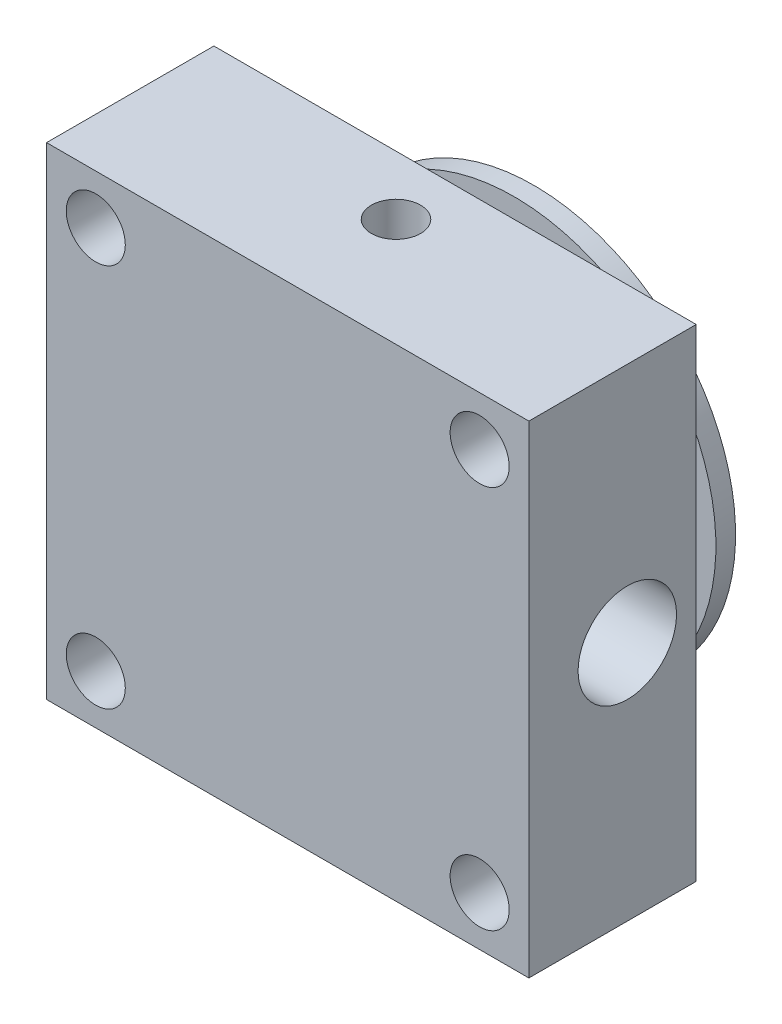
ISO-10303-21;
HEADER;
FILE_DESCRIPTION(('STEP AP214'),'2;1');
FILE_NAME('part.step','',(''),(''),'','','');
FILE_SCHEMA(('AUTOMOTIVE_DESIGN { 1 0 10303 214 1 1 1 1 }'));
ENDSEC;
DATA;
#1=APPLICATION_CONTEXT('core data for automotive mechanical design processes');
#2=APPLICATION_PROTOCOL_DEFINITION('international standard','automotive_design',2000,#1);
#3=PRODUCT_CONTEXT('',#1,'mechanical');
#4=PRODUCT('Part','Part','',(#3));
#5=PRODUCT_RELATED_PRODUCT_CATEGORY('part','',(#4));
#6=PRODUCT_DEFINITION_FORMATION('','',#4);
#7=PRODUCT_DEFINITION_CONTEXT('part definition',#1,'design');
#8=PRODUCT_DEFINITION('design','',#6,#7);
#9=PRODUCT_DEFINITION_SHAPE('','',#8);
#10=(LENGTH_UNIT() NAMED_UNIT(*) SI_UNIT(.MILLI.,.METRE.));
#11=(NAMED_UNIT(*) PLANE_ANGLE_UNIT() SI_UNIT($,.RADIAN.));
#12=(NAMED_UNIT(*) SI_UNIT($,.STERADIAN.) SOLID_ANGLE_UNIT());
#13=UNCERTAINTY_MEASURE_WITH_UNIT(LENGTH_MEASURE(1.E-05),#10,'distance_accuracy_value','');
#14=(GEOMETRIC_REPRESENTATION_CONTEXT(3) GLOBAL_UNCERTAINTY_ASSIGNED_CONTEXT((#13)) GLOBAL_UNIT_ASSIGNED_CONTEXT((#10,
#11,#12)) REPRESENTATION_CONTEXT('',''));
#15=CARTESIAN_POINT('',(0.,0.,0.));
#16=DIRECTION('',(0.,0.,1.));
#17=DIRECTION('',(1.,0.,0.));
#18=AXIS2_PLACEMENT_3D('',#15,#16,#17);
#19=CARTESIAN_POINT('',(-24.5,24.5,20.1734006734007));
#20=DIRECTION('',(0.,0.,1.));
#21=DIRECTION('',(1.,0.,0.));
#22=AXIS2_PLACEMENT_3D('',#19,#20,#21);
#23=CYLINDRICAL_SURFACE('',#22,13.);
#24=CARTESIAN_POINT('',(-24.5,24.5,-7.99999999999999));
#25=DIRECTION('',(0.,0.,-1.));
#26=DIRECTION('',(-1.,0.,0.));
#27=AXIS2_PLACEMENT_3D('',#24,#25,#26);
#28=CIRCLE('',#27,13.);
#29=CARTESIAN_POINT('',(-37.5,24.5,-7.99999999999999));
#30=VERTEX_POINT('',#29);
#31=EDGE_CURVE('E31',#30,#30,#28,.F.);
#32=ORIENTED_EDGE('',*,*,#31,.F.);
#33=EDGE_LOOP('',(#32));
#34=FACE_BOUND('',#33,.T.);
#35=CARTESIAN_POINT('',(-24.5,24.5,-1.99999999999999));
#36=DIRECTION('',(0.,0.,1.));
#37=DIRECTION('',(1.,0.,0.));
#38=AXIS2_PLACEMENT_3D('',#35,#36,#37);
#39=CIRCLE('',#38,13.);
#40=CARTESIAN_POINT('',(-11.5,24.5,-1.99999999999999));
#41=VERTEX_POINT('',#40);
#42=EDGE_CURVE('E92',#41,#41,#39,.T.);
#43=ORIENTED_EDGE('',*,*,#42,.T.);
#44=EDGE_LOOP('',(#43));
#45=FACE_BOUND('',#44,.T.);
#46=ADVANCED_FACE('F27',(#34,#45),#23,.F.);
#47=CARTESIAN_POINT('',(-11.5,24.5,-1.99999999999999));
#48=DIRECTION('',(0.,0.,-1.));
#49=DIRECTION('',(-1.,0.,0.));
#50=AXIS2_PLACEMENT_3D('',#47,#48,#49);
#51=PLANE('',#50);
#52=CARTESIAN_POINT('',(-24.5,24.5,-1.99999999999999));
#53=DIRECTION('',(0.,0.,1.));
#54=DIRECTION('',(1.,0.,0.));
#55=AXIS2_PLACEMENT_3D('',#52,#53,#54);
#56=CIRCLE('',#55,5.);
#57=CARTESIAN_POINT('',(-19.5,24.5,-1.99999999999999));
#58=VERTEX_POINT('',#57);
#59=EDGE_CURVE('E88',#58,#58,#56,.T.);
#60=ORIENTED_EDGE('',*,*,#59,.T.);
#61=EDGE_LOOP('',(#60));
#62=FACE_BOUND('',#61,.T.);
#63=ORIENTED_EDGE('',*,*,#42,.F.);
#64=EDGE_LOOP('',(#63));
#65=FACE_BOUND('',#64,.T.);
#66=ADVANCED_FACE('F201',(#62,#65),#51,.T.);
#67=CARTESIAN_POINT('',(-24.5,24.5,20.1734006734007));
#68=DIRECTION('',(0.,0.,1.));
#69=DIRECTION('',(1.,0.,0.));
#70=AXIS2_PLACEMENT_3D('',#67,#68,#69);
#71=CYLINDRICAL_SURFACE('',#70,5.);
#72=CARTESIAN_POINT('',(-24.5,29.5,8.50000000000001));
#73=CARTESIAN_POINT('',(-24.3685733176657,29.4999917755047,8.499990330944));
#74=CARTESIAN_POINT('',(-24.2369843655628,29.4947619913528,8.48957443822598));
#75=CARTESIAN_POINT('',(-23.9776985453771,29.4743541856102,8.44836817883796));
#76=CARTESIAN_POINT('',(-23.8500095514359,29.4591572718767,8.41753911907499));
#77=CARTESIAN_POINT('',(-23.6026663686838,29.4204069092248,8.33701537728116));
#78=CARTESIAN_POINT('',(-23.4829830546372,29.3968859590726,8.28739401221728));
#79=CARTESIAN_POINT('',(-23.2538183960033,29.3436444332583,8.17107347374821));
#80=CARTESIAN_POINT('',(-23.1443362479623,29.3139243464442,8.10437564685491));
#81=CARTESIAN_POINT('',(-22.93123047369,29.2489064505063,7.95120686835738));
#82=CARTESIAN_POINT('',(-22.8283619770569,29.2133799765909,7.86378379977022));
#83=CARTESIAN_POINT('',(-22.6380513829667,29.1414992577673,7.67369630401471));
#84=CARTESIAN_POINT('',(-22.5506210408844,29.105144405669,7.57102037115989));
#85=CARTESIAN_POINT('',(-22.3868700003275,29.0324737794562,7.34379162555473));
#86=CARTESIAN_POINT('',(-22.3119366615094,28.9963796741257,7.218159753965));
#87=CARTESIAN_POINT('',(-22.1845794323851,28.9321494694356,6.95408166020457));
#88=CARTESIAN_POINT('',(-22.1321394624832,28.9040076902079,6.81564467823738));
#89=CARTESIAN_POINT('',(-22.0546688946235,28.861446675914,6.53833723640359));
#90=CARTESIAN_POINT('',(-22.0281853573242,28.8463067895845,6.39998886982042));
#91=CARTESIAN_POINT('',(-21.9989325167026,28.8295472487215,6.12005290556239));
#92=CARTESIAN_POINT('',(-21.9961397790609,28.8279142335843,5.97846864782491));
#93=CARTESIAN_POINT('',(-22.0132817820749,28.8377732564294,5.71428493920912));
#94=CARTESIAN_POINT('',(-22.0305386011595,28.8477190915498,5.59143992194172));
#95=CARTESIAN_POINT('',(-22.0826503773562,28.8769057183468,5.35069522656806));
#96=CARTESIAN_POINT('',(-22.1175109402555,28.8961494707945,5.23279713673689));
#97=CARTESIAN_POINT('',(-22.2044755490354,28.9421869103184,5.00192716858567));
#98=CARTESIAN_POINT('',(-22.2569623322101,28.9691460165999,4.88913400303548));
#99=CARTESIAN_POINT('',(-22.3773957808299,29.0275851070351,4.67341426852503));
#100=CARTESIAN_POINT('',(-22.4453493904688,29.0590671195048,4.5704921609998));
#101=CARTESIAN_POINT('',(-22.6048348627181,29.1278289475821,4.36369686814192));
#102=CARTESIAN_POINT('',(-22.6982638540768,29.1653377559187,4.26135781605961));
#103=CARTESIAN_POINT('',(-22.9011110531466,29.2386905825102,4.07316145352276));
#104=CARTESIAN_POINT('',(-23.0105368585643,29.27453379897,3.9873120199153));
#105=CARTESIAN_POINT('',(-23.2487087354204,29.3425496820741,3.83078584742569));
#106=CARTESIAN_POINT('',(-23.3781160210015,29.3744746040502,3.76099881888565));
#107=CARTESIAN_POINT('',(-23.648834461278,29.4289470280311,3.64475742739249));
#108=CARTESIAN_POINT('',(-23.7901360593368,29.4515019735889,3.59828453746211));
#109=CARTESIAN_POINT('',(-24.0680837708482,29.4831083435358,3.5338114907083));
#110=CARTESIAN_POINT('',(-24.2041461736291,29.4931234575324,3.51377191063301));
#111=CARTESIAN_POINT('',(-24.4780510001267,29.5018253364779,3.49633817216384));
#112=CARTESIAN_POINT('',(-24.6158925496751,29.5005174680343,3.49893328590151));
#113=CARTESIAN_POINT('',(-24.8780824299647,29.4872798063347,3.52551672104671));
#114=CARTESIAN_POINT('',(-25.0026485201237,29.4761811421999,3.54783133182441));
#115=CARTESIAN_POINT('',(-25.246017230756,29.4455542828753,3.61059517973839));
#116=CARTESIAN_POINT('',(-25.3648192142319,29.4260251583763,3.6510464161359));
#117=CARTESIAN_POINT('',(-25.5972215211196,29.3796062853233,3.74999616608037));
#118=CARTESIAN_POINT('',(-25.7105759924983,29.3525220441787,3.80897762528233));
#119=CARTESIAN_POINT('',(-25.9261534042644,29.2935993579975,3.94276883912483));
#120=CARTESIAN_POINT('',(-26.028371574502,29.2617588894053,4.0175853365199));
#121=CARTESIAN_POINT('',(-26.2294192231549,29.1927055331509,4.1894010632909));
#122=CARTESIAN_POINT('',(-26.326930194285,29.1552721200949,4.28785717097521));
#123=CARTESIAN_POINT('',(-26.5046408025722,29.0815597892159,4.49981287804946));
#124=CARTESIAN_POINT('',(-26.5848284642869,29.0452816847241,4.61332279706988));
#125=CARTESIAN_POINT('',(-26.7292697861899,28.9762798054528,4.85910913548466));
#126=CARTESIAN_POINT('',(-26.7925637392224,28.9438132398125,4.99202816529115));
#127=CARTESIAN_POINT('',(-26.8952070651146,28.8893518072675,5.26877516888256));
#128=CARTESIAN_POINT('',(-26.9345872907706,28.8673434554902,5.412588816));
#129=CARTESIAN_POINT('',(-26.9846542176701,28.8390375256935,5.69227555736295));
#130=CARTESIAN_POINT('',(-26.9977324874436,28.831434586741,5.82758563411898));
#131=CARTESIAN_POINT('',(-27.001722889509,28.8291338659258,6.09861766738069));
#132=CARTESIAN_POINT('',(-26.9926446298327,28.8344304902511,6.23433941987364));
#133=CARTESIAN_POINT('',(-26.9548153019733,28.8559465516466,6.48870875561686));
#134=CARTESIAN_POINT('',(-26.928020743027,28.8710773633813,6.60775118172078));
#135=CARTESIAN_POINT('',(-26.8579384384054,28.909275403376,6.83952029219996));
#136=CARTESIAN_POINT('',(-26.8146453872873,28.9323451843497,6.95224493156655));
#137=CARTESIAN_POINT('',(-26.7095391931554,28.9857132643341,7.17656215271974));
#138=CARTESIAN_POINT('',(-26.646677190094,29.0163930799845,7.28756985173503));
#139=CARTESIAN_POINT('',(-26.5053780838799,29.0808832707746,7.49818624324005));
#140=CARTESIAN_POINT('',(-26.4269328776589,29.1146952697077,7.59778896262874));
#141=CARTESIAN_POINT('',(-26.2455055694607,29.1865581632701,7.79535536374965));
#142=CARTESIAN_POINT('',(-26.1407002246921,29.2246249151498,7.89164936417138));
#143=CARTESIAN_POINT('',(-25.9153978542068,29.2969434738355,8.06565584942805));
#144=CARTESIAN_POINT('',(-25.7948924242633,29.3311932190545,8.14335831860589));
#145=CARTESIAN_POINT('',(-25.5397880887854,29.3924514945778,8.27809697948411));
#146=CARTESIAN_POINT('',(-25.4050955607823,29.4194071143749,8.33498316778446));
#147=CARTESIAN_POINT('',(-25.1963287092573,29.4517796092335,8.4021838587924));
#148=CARTESIAN_POINT('',(-25.1256704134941,29.4612231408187,8.42155539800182));
#149=CARTESIAN_POINT('',(-24.9826239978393,29.477171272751,8.45406594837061));
#150=CARTESIAN_POINT('',(-24.9102369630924,29.4836776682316,8.46720876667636));
#151=CARTESIAN_POINT('',(-24.7815186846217,29.4923820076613,8.48473747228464));
#152=CARTESIAN_POINT('',(-24.7254084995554,29.4952328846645,8.49045493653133));
#153=CARTESIAN_POINT('',(-24.6128755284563,29.4990436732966,8.49808832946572));
#154=CARTESIAN_POINT('',(-24.5564527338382,29.500003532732,8.50000415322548));
#155=CARTESIAN_POINT('',(-24.5,29.5,8.50000000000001));
#156=B_SPLINE_CURVE_WITH_KNOTS('',3,(#72,#73,#74,#75,#76,#77,#78,#79,#80,#81,#82,#83,#84,#85,
#86,#87,#88,#89,#90,#91,#92,#93,#94,#95,#96,#97,#98,#99,#100,#101,#102,#103,#104,#105,#106,#107,
#108,#109,#110,#111,#112,#113,#114,#115,#116,#117,#118,#119,#120,#121,#122,#123,#124,#125,#126,
#127,#128,#129,#130,#131,#132,#133,#134,#135,#136,#137,#138,#139,#140,#141,#142,#143,#144,#145,
#146,#147,#148,#149,#150,#151,#152,#153,#154,#155),.UNSPECIFIED.,.T.,.F.,(4,2,2,2,2,2,2,2,2,2,2,
2,2,2,2,2,2,2,2,2,2,2,2,2,2,2,2,2,2,2,2,2,2,2,2,2,2,2,2,2,2,4),(0.,0.39406064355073,
0.788870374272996,1.18215538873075,1.57540940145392,1.99245439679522,2.40981559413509,
2.85954316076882,3.30894869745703,3.73145030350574,4.15353393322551,4.52514281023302,
4.89687009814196,5.27725600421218,5.65781303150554,6.08662353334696,6.51563836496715,
6.96457555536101,7.41315542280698,7.82458226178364,8.2358141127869,8.61517266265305,
8.99457304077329,9.38482140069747,9.77523626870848,10.2039902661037,10.6330397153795,
11.0828670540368,11.53211279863,11.9382326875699,12.3441764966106,12.7114482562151,
13.0788382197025,13.4709114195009,13.8631890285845,14.303131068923,14.7433095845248,
15.1866003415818,15.407934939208,15.6291340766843,15.7983933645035,15.9676573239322),.UNSPECIFIED.);
#157=CARTESIAN_POINT('',(-24.5,29.5,8.50000000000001));
#158=VERTEX_POINT('',#157);
#159=EDGE_CURVE('E95',#158,#158,#156,.T.);
#160=ORIENTED_EDGE('',*,*,#159,.T.);
#161=EDGE_LOOP('',(#160));
#162=FACE_BOUND('',#161,.T.);
#163=CARTESIAN_POINT('',(-24.5,24.5,10.));
#164=DIRECTION('',(0.,0.,1.));
#165=DIRECTION('',(1.,0.,0.));
#166=AXIS2_PLACEMENT_3D('',#163,#164,#165);
#167=CIRCLE('',#166,5.);
#168=CARTESIAN_POINT('',(-19.5,24.5,10.));
#169=VERTEX_POINT('',#168);
#170=EDGE_CURVE('E86',#169,#169,#167,.T.);
#171=ORIENTED_EDGE('',*,*,#170,.T.);
#172=EDGE_LOOP('',(#171));
#173=FACE_BOUND('',#172,.T.);
#174=ORIENTED_EDGE('',*,*,#59,.F.);
#175=EDGE_LOOP('',(#174));
#176=FACE_BOUND('',#175,.T.);
#177=ADVANCED_FACE('F82',(#162,#173,#176),#71,.F.);
#178=CARTESIAN_POINT('',(-24.5,24.5,10.));
#179=DIRECTION('',(0.,0.,-1.));
#180=DIRECTION('',(-1.,0.,0.));
#181=AXIS2_PLACEMENT_3D('',#178,#179,#180);
#182=CONICAL_SURFACE('',#181,5.,1.0471975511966);
#183=CARTESIAN_POINT('',(-24.5,24.5,12.8867513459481));
#184=VERTEX_POINT('',#183);
#185=VERTEX_LOOP('',#184);
#186=FACE_BOUND('',#185,.T.);
#187=ORIENTED_EDGE('',*,*,#170,.F.);
#188=EDGE_LOOP('',(#187));
#189=FACE_BOUND('',#188,.T.);
#190=ADVANCED_FACE('F78',(#186,#189),#182,.F.);
#191=CARTESIAN_POINT('',(-24.5,24.5,-7.99999999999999));
#192=DIRECTION('',(0.,0.,-1.));
#193=DIRECTION('',(-1.,0.,0.));
#194=AXIS2_PLACEMENT_3D('',#191,#192,#193);
#195=PLANE('',#194);
#196=CARTESIAN_POINT('',(-24.5,24.5,-7.99999999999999));
#197=DIRECTION('',(0.,0.,-1.));
#198=DIRECTION('',(-1.,0.,0.));
#199=AXIS2_PLACEMENT_3D('',#196,#197,#198);
#200=CIRCLE('',#199,20.5);
#201=CARTESIAN_POINT('',(-45.,24.5,-7.99999999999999));
#202=VERTEX_POINT('',#201);
#203=EDGE_CURVE('E144',#202,#202,#200,.T.);
#204=ORIENTED_EDGE('',*,*,#203,.T.);
#205=EDGE_LOOP('',(#204));
#206=FACE_BOUND('',#205,.T.);
#207=ORIENTED_EDGE('',*,*,#31,.T.);
#208=EDGE_LOOP('',(#207));
#209=FACE_BOUND('',#208,.T.);
#210=ADVANCED_FACE('F81',(#206,#209),#195,.T.);
#211=CARTESIAN_POINT('',(-17.5539814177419,24.5,7.));
#212=DIRECTION('',(-1.,0.,0.));
#213=DIRECTION('',(0.,0.,1.));
#214=AXIS2_PLACEMENT_3D('',#211,#212,#213);
#215=CYLINDRICAL_SURFACE('',#214,5.);
#216=CARTESIAN_POINT('',(-9.99999999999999,24.5,7.));
#217=DIRECTION('',(-1.,0.,0.));
#218=DIRECTION('',(0.,0.,1.));
#219=AXIS2_PLACEMENT_3D('',#216,#217,#218);
#220=CIRCLE('',#219,5.);
#221=CARTESIAN_POINT('',(-9.99999999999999,24.5,12.));
#222=VERTEX_POINT('',#221);
#223=EDGE_CURVE('E105',#222,#222,#220,.T.);
#224=ORIENTED_EDGE('',*,*,#223,.T.);
#225=EDGE_LOOP('',(#224));
#226=FACE_BOUND('',#225,.T.);
#227=CARTESIAN_POINT('',(0.,24.5,7.));
#228=DIRECTION('',(-1.,0.,0.));
#229=DIRECTION('',(0.,0.,1.));
#230=AXIS2_PLACEMENT_3D('',#227,#228,#229);
#231=CIRCLE('',#230,5.);
#232=CARTESIAN_POINT('',(0.,24.5,12.));
#233=VERTEX_POINT('',#232);
#234=EDGE_CURVE('E108',#233,#233,#231,.F.);
#235=ORIENTED_EDGE('',*,*,#234,.T.);
#236=EDGE_LOOP('',(#235));
#237=FACE_BOUND('',#236,.T.);
#238=ADVANCED_FACE('F265',(#226,#237),#215,.F.);
#239=CARTESIAN_POINT('',(-9.99999999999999,24.5,7.));
#240=DIRECTION('',(1.,0.,0.));
#241=DIRECTION('',(0.,0.,-1.));
#242=AXIS2_PLACEMENT_3D('',#239,#240,#241);
#243=CONICAL_SURFACE('',#242,5.,1.04719755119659);
#244=CARTESIAN_POINT('',(-12.8867513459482,24.5,7.));
#245=VERTEX_POINT('',#244);
#246=VERTEX_LOOP('',#245);
#247=FACE_BOUND('',#246,.T.);
#248=ORIENTED_EDGE('',*,*,#223,.F.);
#249=EDGE_LOOP('',(#248));
#250=FACE_BOUND('',#249,.T.);
#251=ADVANCED_FACE('F258',(#247,#250),#243,.F.);
#252=CARTESIAN_POINT('',(0.,0.,17.));
#253=DIRECTION('',(-1.,0.,0.));
#254=DIRECTION('',(0.,0.,1.));
#255=AXIS2_PLACEMENT_3D('',#252,#253,#254);
#256=PLANE('',#255);
#257=DIRECTION('',(0.,0.,-1.));
#258=VECTOR('',#257,1.);
#259=CARTESIAN_POINT('',(0.,49.,17.));
#260=LINE('',#259,#258);
#261=CARTESIAN_POINT('',(0.,49.,17.));
#262=VERTEX_POINT('',#261);
#263=CARTESIAN_POINT('',(0.,49.,0.));
#264=VERTEX_POINT('',#263);
#265=EDGE_CURVE('E11',#262,#264,#260,.T.);
#266=ORIENTED_EDGE('',*,*,#265,.F.);
#267=DIRECTION('',(0.,1.,0.));
#268=VECTOR('',#267,1.);
#269=CARTESIAN_POINT('',(0.,0.,17.));
#270=LINE('',#269,#268);
#271=CARTESIAN_POINT('',(0.,0.,17.));
#272=VERTEX_POINT('',#271);
#273=EDGE_CURVE('E158',#272,#262,#270,.T.);
#274=ORIENTED_EDGE('',*,*,#273,.F.);
#275=DIRECTION('',(0.,0.,-1.));
#276=VECTOR('',#275,1.);
#277=CARTESIAN_POINT('',(0.,0.,17.));
#278=LINE('',#277,#276);
#279=CARTESIAN_POINT('',(0.,0.,0.));
#280=VERTEX_POINT('',#279);
#281=EDGE_CURVE('E44',#272,#280,#278,.T.);
#282=ORIENTED_EDGE('',*,*,#281,.T.);
#283=DIRECTION('',(0.,1.,0.));
#284=VECTOR('',#283,1.);
#285=CARTESIAN_POINT('',(0.,0.,0.));
#286=LINE('',#285,#284);
#287=EDGE_CURVE('E147',#280,#264,#286,.T.);
#288=ORIENTED_EDGE('',*,*,#287,.T.);
#289=EDGE_LOOP('',(#266,#274,#282,#288));
#290=FACE_BOUND('',#289,.T.);
#291=ORIENTED_EDGE('',*,*,#234,.F.);
#292=EDGE_LOOP('',(#291));
#293=FACE_BOUND('',#292,.T.);
#294=ADVANCED_FACE('F256',(#290,#293),#256,.F.);
#295=CARTESIAN_POINT('',(-24.5,24.5,-7.99999999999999));
#296=DIRECTION('',(0.,0.,1.));
#297=DIRECTION('',(1.,0.,0.));
#298=AXIS2_PLACEMENT_3D('',#295,#296,#297);
#299=CYLINDRICAL_SURFACE('',#298,20.5);
#300=CARTESIAN_POINT('',(-24.5,24.5,0.));
#301=DIRECTION('',(0.,0.,-1.));
#302=DIRECTION('',(-1.,0.,0.));
#303=AXIS2_PLACEMENT_3D('',#300,#301,#302);
#304=CIRCLE('',#303,20.5);
#305=CARTESIAN_POINT('',(-45.,24.5,0.));
#306=VERTEX_POINT('',#305);
#307=EDGE_CURVE('E141',#306,#306,#304,.T.);
#308=ORIENTED_EDGE('',*,*,#307,.T.);
#309=EDGE_LOOP('',(#308));
#310=FACE_BOUND('',#309,.T.);
#311=CARTESIAN_POINT('',(-24.5,24.5,-2.));
#312=DIRECTION('',(0.,0.,-1.));
#313=DIRECTION('',(-1.,0.,0.));
#314=AXIS2_PLACEMENT_3D('',#311,#312,#313);
#315=CIRCLE('',#314,20.5);
#316=CARTESIAN_POINT('',(-45.,24.5,-2.));
#317=VERTEX_POINT('',#316);
#318=EDGE_CURVE('E120',#317,#317,#315,.T.);
#319=ORIENTED_EDGE('',*,*,#318,.F.);
#320=EDGE_LOOP('',(#319));
#321=FACE_BOUND('',#320,.T.);
#322=ADVANCED_FACE('F197',(#310,#321),#299,.T.);
#323=CARTESIAN_POINT('',(0.,49.,0.));
#324=DIRECTION('',(0.,0.,-1.));
#325=DIRECTION('',(-1.,0.,0.));
#326=AXIS2_PLACEMENT_3D('',#323,#324,#325);
#327=PLANE('',#326);
#328=CARTESIAN_POINT('',(-5.,5.,0.));
#329=DIRECTION('',(0.,0.,-1.));
#330=DIRECTION('',(-1.,0.,0.));
#331=AXIS2_PLACEMENT_3D('',#328,#329,#330);
#332=CIRCLE('',#331,3.);
#333=CARTESIAN_POINT('',(-8.,5.,0.));
#334=VERTEX_POINT('',#333);
#335=EDGE_CURVE('E119',#334,#334,#332,.T.);
#336=ORIENTED_EDGE('',*,*,#335,.F.);
#337=EDGE_LOOP('',(#336));
#338=FACE_BOUND('',#337,.T.);
#339=CARTESIAN_POINT('',(-44.,5.00000000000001,0.));
#340=DIRECTION('',(0.,0.,-1.));
#341=DIRECTION('',(-1.,0.,0.));
#342=AXIS2_PLACEMENT_3D('',#339,#340,#341);
#343=CIRCLE('',#342,3.);
#344=CARTESIAN_POINT('',(-47.,5.00000000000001,0.));
#345=VERTEX_POINT('',#344);
#346=EDGE_CURVE('E126',#345,#345,#343,.T.);
#347=ORIENTED_EDGE('',*,*,#346,.F.);
#348=EDGE_LOOP('',(#347));
#349=FACE_BOUND('',#348,.T.);
#350=CARTESIAN_POINT('',(-5.,44.,0.));
#351=DIRECTION('',(0.,0.,-1.));
#352=DIRECTION('',(-1.,0.,0.));
#353=AXIS2_PLACEMENT_3D('',#350,#351,#352);
#354=CIRCLE('',#353,3.);
#355=CARTESIAN_POINT('',(-8.,44.,0.));
#356=VERTEX_POINT('',#355);
#357=EDGE_CURVE('E132',#356,#356,#354,.T.);
#358=ORIENTED_EDGE('',*,*,#357,.F.);
#359=EDGE_LOOP('',(#358));
#360=FACE_BOUND('',#359,.T.);
#361=CARTESIAN_POINT('',(-44.,44.,0.));
#362=DIRECTION('',(0.,0.,-1.));
#363=DIRECTION('',(-1.,0.,0.));
#364=AXIS2_PLACEMENT_3D('',#361,#362,#363);
#365=CIRCLE('',#364,3.);
#366=CARTESIAN_POINT('',(-47.,44.,0.));
#367=VERTEX_POINT('',#366);
#368=EDGE_CURVE('E138',#367,#367,#365,.T.);
#369=ORIENTED_EDGE('',*,*,#368,.F.);
#370=EDGE_LOOP('',(#369));
#371=FACE_BOUND('',#370,.T.);
#372=ORIENTED_EDGE('',*,*,#287,.F.);
#373=DIRECTION('',(-1.,0.,0.));
#374=VECTOR('',#373,1.);
#375=CARTESIAN_POINT('',(0.,0.,0.));
#376=LINE('',#375,#374);
#377=CARTESIAN_POINT('',(-49.,0.,0.));
#378=VERTEX_POINT('',#377);
#379=EDGE_CURVE('E155',#280,#378,#376,.T.);
#380=ORIENTED_EDGE('',*,*,#379,.T.);
#381=DIRECTION('',(0.,-1.,0.));
#382=VECTOR('',#381,1.);
#383=CARTESIAN_POINT('',(-49.,49.,0.));
#384=LINE('',#383,#382);
#385=CARTESIAN_POINT('',(-49.,49.,0.));
#386=VERTEX_POINT('',#385);
#387=EDGE_CURVE('E153',#386,#378,#384,.T.);
#388=ORIENTED_EDGE('',*,*,#387,.F.);
#389=DIRECTION('',(1.,0.,0.));
#390=VECTOR('',#389,1.);
#391=CARTESIAN_POINT('',(-49.,49.,0.));
#392=LINE('',#391,#390);
#393=EDGE_CURVE('E150',#386,#264,#392,.T.);
#394=ORIENTED_EDGE('',*,*,#393,.T.);
#395=EDGE_LOOP('',(#372,#380,#388,#394));
#396=FACE_BOUND('',#395,.T.);
#397=ORIENTED_EDGE('',*,*,#307,.F.);
#398=EDGE_LOOP('',(#397));
#399=FACE_BOUND('',#398,.T.);
#400=ADVANCED_FACE('F229',(#338,#349,#360,#371,#396,#399),#327,.T.);
#401=CARTESIAN_POINT('',(-49.,49.,17.));
#402=DIRECTION('',(0.,1.,0.));
#403=DIRECTION('',(0.,0.,1.));
#404=AXIS2_PLACEMENT_3D('',#401,#402,#403);
#405=PLANE('',#404);
#406=CARTESIAN_POINT('',(-24.5,49.,6.00000000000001));
#407=DIRECTION('',(0.,1.,0.));
#408=DIRECTION('',(0.,0.,1.));
#409=AXIS2_PLACEMENT_3D('',#406,#407,#408);
#410=CIRCLE('',#409,2.5);
#411=CARTESIAN_POINT('',(-24.5,49.,8.50000000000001));
#412=VERTEX_POINT('',#411);
#413=EDGE_CURVE('E89',#412,#412,#410,.T.);
#414=ORIENTED_EDGE('',*,*,#413,.F.);
#415=EDGE_LOOP('',(#414));
#416=FACE_BOUND('',#415,.T.);
#417=DIRECTION('',(0.,0.,-1.));
#418=VECTOR('',#417,1.);
#419=CARTESIAN_POINT('',(-49.,49.,17.));
#420=LINE('',#419,#418);
#421=CARTESIAN_POINT('',(-49.,49.,17.));
#422=VERTEX_POINT('',#421);
#423=EDGE_CURVE('E36',#422,#386,#420,.T.);
#424=ORIENTED_EDGE('',*,*,#423,.F.);
#425=DIRECTION('',(1.,0.,0.));
#426=VECTOR('',#425,1.);
#427=CARTESIAN_POINT('',(-49.,49.,17.));
#428=LINE('',#427,#426);
#429=EDGE_CURVE('E161',#422,#262,#428,.T.);
#430=ORIENTED_EDGE('',*,*,#429,.T.);
#431=ORIENTED_EDGE('',*,*,#265,.T.);
#432=ORIENTED_EDGE('',*,*,#393,.F.);
#433=EDGE_LOOP('',(#424,#430,#431,#432));
#434=FACE_BOUND('',#433,.T.);
#435=ADVANCED_FACE('F29',(#416,#434),#405,.T.);
#436=CARTESIAN_POINT('',(-49.,49.,17.));
#437=DIRECTION('',(1.,0.,0.));
#438=DIRECTION('',(0.,0.,-1.));
#439=AXIS2_PLACEMENT_3D('',#436,#437,#438);
#440=PLANE('',#439);
#441=CARTESIAN_POINT('',(-49.,24.5,7.));
#442=DIRECTION('',(1.,0.,0.));
#443=DIRECTION('',(0.,0.,-1.));
#444=AXIS2_PLACEMENT_3D('',#441,#442,#443);
#445=CIRCLE('',#444,5.);
#446=CARTESIAN_POINT('',(-49.,24.5,2.));
#447=VERTEX_POINT('',#446);
#448=EDGE_CURVE('E104',#447,#447,#445,.T.);
#449=ORIENTED_EDGE('',*,*,#448,.T.);
#450=EDGE_LOOP('',(#449));
#451=FACE_BOUND('',#450,.T.);
#452=DIRECTION('',(0.,0.,-1.));
#453=VECTOR('',#452,1.);
#454=CARTESIAN_POINT('',(-49.,0.,17.));
#455=LINE('',#454,#453);
#456=CARTESIAN_POINT('',(-49.,0.,17.));
#457=VERTEX_POINT('',#456);
#458=EDGE_CURVE('E52',#457,#378,#455,.T.);
#459=ORIENTED_EDGE('',*,*,#458,.F.);
#460=DIRECTION('',(0.,-1.,0.));
#461=VECTOR('',#460,1.);
#462=CARTESIAN_POINT('',(-49.,49.,17.));
#463=LINE('',#462,#461);
#464=EDGE_CURVE('E164',#422,#457,#463,.T.);
#465=ORIENTED_EDGE('',*,*,#464,.F.);
#466=ORIENTED_EDGE('',*,*,#423,.T.);
#467=ORIENTED_EDGE('',*,*,#387,.T.);
#468=EDGE_LOOP('',(#459,#465,#466,#467));
#469=FACE_BOUND('',#468,.T.);
#470=ADVANCED_FACE('F179',(#451,#469),#440,.F.);
#471=CARTESIAN_POINT('',(0.,0.,17.));
#472=DIRECTION('',(0.,-1.,0.));
#473=DIRECTION('',(1.,0.,0.));
#474=AXIS2_PLACEMENT_3D('',#471,#472,#473);
#475=PLANE('',#474);
#476=DIRECTION('',(-1.,0.,0.));
#477=VECTOR('',#476,1.);
#478=CARTESIAN_POINT('',(0.,0.,17.));
#479=LINE('',#478,#477);
#480=EDGE_CURVE('E166',#272,#457,#479,.T.);
#481=ORIENTED_EDGE('',*,*,#480,.T.);
#482=ORIENTED_EDGE('',*,*,#458,.T.);
#483=ORIENTED_EDGE('',*,*,#379,.F.);
#484=ORIENTED_EDGE('',*,*,#281,.F.);
#485=EDGE_LOOP('',(#481,#482,#483,#484));
#486=FACE_BOUND('',#485,.T.);
#487=ADVANCED_FACE('F237',(#486),#475,.T.);
#488=CARTESIAN_POINT('',(0.,49.,17.));
#489=DIRECTION('',(0.,0.,-1.));
#490=DIRECTION('',(-1.,0.,0.));
#491=AXIS2_PLACEMENT_3D('',#488,#489,#490);
#492=PLANE('',#491);
#493=CARTESIAN_POINT('',(-5.,5.,17.));
#494=DIRECTION('',(0.,0.,1.));
#495=DIRECTION('',(1.,0.,0.));
#496=AXIS2_PLACEMENT_3D('',#493,#494,#495);
#497=CIRCLE('',#496,3.);
#498=CARTESIAN_POINT('',(-2.,5.,17.));
#499=VERTEX_POINT('',#498);
#500=EDGE_CURVE('E116',#499,#499,#497,.T.);
#501=ORIENTED_EDGE('',*,*,#500,.F.);
#502=EDGE_LOOP('',(#501));
#503=FACE_BOUND('',#502,.T.);
#504=CARTESIAN_POINT('',(-44.,5.00000000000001,17.));
#505=DIRECTION('',(0.,0.,1.));
#506=DIRECTION('',(1.,0.,0.));
#507=AXIS2_PLACEMENT_3D('',#504,#505,#506);
#508=CIRCLE('',#507,3.);
#509=CARTESIAN_POINT('',(-41.,5.00000000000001,17.));
#510=VERTEX_POINT('',#509);
#511=EDGE_CURVE('E123',#510,#510,#508,.T.);
#512=ORIENTED_EDGE('',*,*,#511,.F.);
#513=EDGE_LOOP('',(#512));
#514=FACE_BOUND('',#513,.T.);
#515=CARTESIAN_POINT('',(-5.,44.,17.));
#516=DIRECTION('',(0.,0.,1.));
#517=DIRECTION('',(1.,0.,0.));
#518=AXIS2_PLACEMENT_3D('',#515,#516,#517);
#519=CIRCLE('',#518,3.);
#520=CARTESIAN_POINT('',(-2.,44.,17.));
#521=VERTEX_POINT('',#520);
#522=EDGE_CURVE('E129',#521,#521,#519,.T.);
#523=ORIENTED_EDGE('',*,*,#522,.F.);
#524=EDGE_LOOP('',(#523));
#525=FACE_BOUND('',#524,.T.);
#526=CARTESIAN_POINT('',(-44.,44.,17.));
#527=DIRECTION('',(0.,0.,1.));
#528=DIRECTION('',(1.,0.,0.));
#529=AXIS2_PLACEMENT_3D('',#526,#527,#528);
#530=CIRCLE('',#529,3.);
#531=CARTESIAN_POINT('',(-41.,44.,17.));
#532=VERTEX_POINT('',#531);
#533=EDGE_CURVE('E135',#532,#532,#530,.T.);
#534=ORIENTED_EDGE('',*,*,#533,.F.);
#535=EDGE_LOOP('',(#534));
#536=FACE_BOUND('',#535,.T.);
#537=ORIENTED_EDGE('',*,*,#273,.T.);
#538=ORIENTED_EDGE('',*,*,#429,.F.);
#539=ORIENTED_EDGE('',*,*,#464,.T.);
#540=ORIENTED_EDGE('',*,*,#480,.F.);
#541=EDGE_LOOP('',(#537,#538,#539,#540));
#542=FACE_BOUND('',#541,.T.);
#543=ADVANCED_FACE('F234',(#503,#514,#525,#536,#542),#492,.F.);
#544=CARTESIAN_POINT('',(-44.,44.,-7.99999999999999));
#545=DIRECTION('',(0.,0.,1.));
#546=DIRECTION('',(1.,0.,0.));
#547=AXIS2_PLACEMENT_3D('',#544,#545,#546);
#548=CYLINDRICAL_SURFACE('',#547,3.);
#549=ORIENTED_EDGE('',*,*,#368,.T.);
#550=EDGE_LOOP('',(#549));
#551=FACE_BOUND('',#550,.T.);
#552=ORIENTED_EDGE('',*,*,#533,.T.);
#553=EDGE_LOOP('',(#552));
#554=FACE_BOUND('',#553,.T.);
#555=ADVANCED_FACE('F242',(#551,#554),#548,.F.);
#556=CARTESIAN_POINT('',(-5.,44.,-7.99999999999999));
#557=DIRECTION('',(0.,0.,1.));
#558=DIRECTION('',(1.,0.,0.));
#559=AXIS2_PLACEMENT_3D('',#556,#557,#558);
#560=CYLINDRICAL_SURFACE('',#559,3.);
#561=ORIENTED_EDGE('',*,*,#357,.T.);
#562=EDGE_LOOP('',(#561));
#563=FACE_BOUND('',#562,.T.);
#564=ORIENTED_EDGE('',*,*,#522,.T.);
#565=EDGE_LOOP('',(#564));
#566=FACE_BOUND('',#565,.T.);
#567=ADVANCED_FACE('F249',(#563,#566),#560,.F.);
#568=CARTESIAN_POINT('',(-44.,5.00000000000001,-7.99999999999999));
#569=DIRECTION('',(0.,0.,1.));
#570=DIRECTION('',(1.,0.,0.));
#571=AXIS2_PLACEMENT_3D('',#568,#569,#570);
#572=CYLINDRICAL_SURFACE('',#571,3.);
#573=ORIENTED_EDGE('',*,*,#346,.T.);
#574=EDGE_LOOP('',(#573));
#575=FACE_BOUND('',#574,.T.);
#576=ORIENTED_EDGE('',*,*,#511,.T.);
#577=EDGE_LOOP('',(#576));
#578=FACE_BOUND('',#577,.T.);
#579=ADVANCED_FACE('F293',(#575,#578),#572,.F.);
#580=CARTESIAN_POINT('',(-5.,5.,-7.99999999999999));
#581=DIRECTION('',(0.,0.,1.));
#582=DIRECTION('',(1.,0.,0.));
#583=AXIS2_PLACEMENT_3D('',#580,#581,#582);
#584=CYLINDRICAL_SURFACE('',#583,3.);
#585=ORIENTED_EDGE('',*,*,#335,.T.);
#586=EDGE_LOOP('',(#585));
#587=FACE_BOUND('',#586,.T.);
#588=ORIENTED_EDGE('',*,*,#500,.T.);
#589=EDGE_LOOP('',(#588));
#590=FACE_BOUND('',#589,.T.);
#591=ADVANCED_FACE('F289',(#587,#590),#584,.F.);
#592=CARTESIAN_POINT('',(-24.5,24.5,-2.));
#593=DIRECTION('',(0.,0.,-1.));
#594=DIRECTION('',(-1.,0.,0.));
#595=AXIS2_PLACEMENT_3D('',#592,#593,#594);
#596=PLANE('',#595);
#597=CARTESIAN_POINT('',(-24.5,24.5,-2.));
#598=DIRECTION('',(0.,0.,-1.));
#599=DIRECTION('',(-1.,0.,0.));
#600=AXIS2_PLACEMENT_3D('',#597,#598,#599);
#601=CIRCLE('',#600,17.5);
#602=CARTESIAN_POINT('',(-42.,24.5,-2.));
#603=VERTEX_POINT('',#602);
#604=EDGE_CURVE('E112',#603,#603,#601,.T.);
#605=ORIENTED_EDGE('',*,*,#604,.F.);
#606=EDGE_LOOP('',(#605));
#607=FACE_BOUND('',#606,.T.);
#608=ORIENTED_EDGE('',*,*,#318,.T.);
#609=EDGE_LOOP('',(#608));
#610=FACE_BOUND('',#609,.T.);
#611=ADVANCED_FACE('F285',(#607,#610),#596,.T.);
#612=CARTESIAN_POINT('',(-24.5,24.5,-6.00000000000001));
#613=DIRECTION('',(0.,0.,-1.));
#614=DIRECTION('',(-1.,0.,0.));
#615=AXIS2_PLACEMENT_3D('',#612,#613,#614);
#616=PLANE('',#615);
#617=CARTESIAN_POINT('',(-24.5,24.5,-6.00000000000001));
#618=DIRECTION('',(0.,0.,-1.));
#619=DIRECTION('',(-1.,0.,0.));
#620=AXIS2_PLACEMENT_3D('',#617,#618,#619);
#621=CIRCLE('',#620,17.5);
#622=CARTESIAN_POINT('',(-42.,24.5,-6.00000000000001));
#623=VERTEX_POINT('',#622);
#624=EDGE_CURVE('E109',#623,#623,#621,.T.);
#625=ORIENTED_EDGE('',*,*,#624,.T.);
#626=EDGE_LOOP('',(#625));
#627=FACE_BOUND('',#626,.T.);
#628=CARTESIAN_POINT('',(-24.5,24.5,-6.00000000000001));
#629=DIRECTION('',(0.,0.,-1.));
#630=DIRECTION('',(-1.,0.,0.));
#631=AXIS2_PLACEMENT_3D('',#628,#629,#630);
#632=CIRCLE('',#631,20.5);
#633=CARTESIAN_POINT('',(-45.,24.5,-6.00000000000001));
#634=VERTEX_POINT('',#633);
#635=EDGE_CURVE('E115',#634,#634,#632,.T.);
#636=ORIENTED_EDGE('',*,*,#635,.F.);
#637=EDGE_LOOP('',(#636));
#638=FACE_BOUND('',#637,.T.);
#639=ADVANCED_FACE('F281',(#627,#638),#616,.F.);
#640=CARTESIAN_POINT('',(-24.5,24.5,-2.));
#641=DIRECTION('',(0.,0.,-1.));
#642=DIRECTION('',(-1.,0.,0.));
#643=AXIS2_PLACEMENT_3D('',#640,#641,#642);
#644=CYLINDRICAL_SURFACE('',#643,17.5);
#645=ORIENTED_EDGE('',*,*,#604,.T.);
#646=EDGE_LOOP('',(#645));
#647=FACE_BOUND('',#646,.T.);
#648=ORIENTED_EDGE('',*,*,#624,.F.);
#649=EDGE_LOOP('',(#648));
#650=FACE_BOUND('',#649,.T.);
#651=ADVANCED_FACE('F194',(#647,#650),#644,.T.);
#652=ORIENTED_EDGE('',*,*,#635,.T.);
#653=EDGE_LOOP('',(#652));
#654=FACE_BOUND('',#653,.T.);
#655=ORIENTED_EDGE('',*,*,#203,.F.);
#656=EDGE_LOOP('',(#655));
#657=FACE_BOUND('',#656,.T.);
#658=ADVANCED_FACE('F184',(#654,#657),#299,.T.);
#659=CARTESIAN_POINT('',(-69.6879625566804,24.5,7.));
#660=DIRECTION('',(-1.,0.,0.));
#661=DIRECTION('',(0.,0.,1.));
#662=AXIS2_PLACEMENT_3D('',#659,#660,#661);
#663=CYLINDRICAL_SURFACE('',#662,5.);
#664=CARTESIAN_POINT('',(-39.,24.5,7.));
#665=DIRECTION('',(-1.,0.,0.));
#666=DIRECTION('',(0.,0.,1.));
#667=AXIS2_PLACEMENT_3D('',#664,#665,#666);
#668=CIRCLE('',#667,5.);
#669=CARTESIAN_POINT('',(-39.,24.5,12.));
#670=VERTEX_POINT('',#669);
#671=EDGE_CURVE('E101',#670,#670,#668,.T.);
#672=ORIENTED_EDGE('',*,*,#671,.F.);
#673=EDGE_LOOP('',(#672));
#674=FACE_BOUND('',#673,.T.);
#675=ORIENTED_EDGE('',*,*,#448,.F.);
#676=EDGE_LOOP('',(#675));
#677=FACE_BOUND('',#676,.T.);
#678=ADVANCED_FACE('F181',(#674,#677),#663,.F.);
#679=CARTESIAN_POINT('',(-39.,24.5,7.));
#680=DIRECTION('',(-1.,0.,0.));
#681=DIRECTION('',(0.,0.,1.));
#682=AXIS2_PLACEMENT_3D('',#679,#680,#681);
#683=CONICAL_SURFACE('',#682,5.,1.04719755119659);
#684=CARTESIAN_POINT('',(-36.1132486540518,24.5,7.));
#685=VERTEX_POINT('',#684);
#686=VERTEX_LOOP('',#685);
#687=FACE_BOUND('',#686,.T.);
#688=ORIENTED_EDGE('',*,*,#671,.T.);
#689=EDGE_LOOP('',(#688));
#690=FACE_BOUND('',#689,.T.);
#691=ADVANCED_FACE('F183',(#687,#690),#683,.F.);
#692=CARTESIAN_POINT('',(-24.5,-0.001000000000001,6.00000000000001));
#693=DIRECTION('',(0.,1.,0.));
#694=DIRECTION('',(0.,0.,1.));
#695=AXIS2_PLACEMENT_3D('',#692,#693,#694);
#696=CYLINDRICAL_SURFACE('',#695,2.5);
#697=ORIENTED_EDGE('',*,*,#159,.F.);
#698=EDGE_LOOP('',(#697));
#699=FACE_BOUND('',#698,.T.);
#700=ORIENTED_EDGE('',*,*,#413,.T.);
#701=EDGE_LOOP('',(#700));
#702=FACE_BOUND('',#701,.T.);
#703=ADVANCED_FACE('F191',(#699,#702),#696,.F.);
#704=CLOSED_SHELL('',(#46,#66,#177,#190,#210,#238,#251,#294,#322,#400,#435,#470,#487,#543,#555,
#567,#579,#591,#611,#639,#651,#658,#678,#691,#703));
#705=MANIFOLD_SOLID_BREP('B2',#704);
#706=ADVANCED_BREP_SHAPE_REPRESENTATION('',(#18,#705),#14);
#707=SHAPE_DEFINITION_REPRESENTATION(#9,#706);
ENDSEC;
END-ISO-10303-21;
